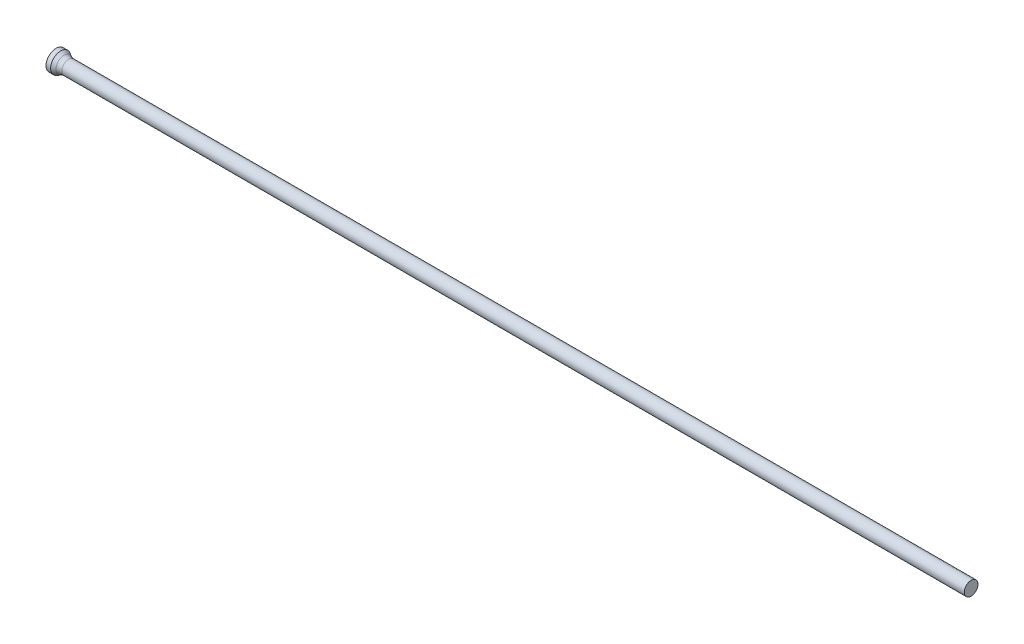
ISO-10303-21;
HEADER;
FILE_DESCRIPTION(('STEP AP214'),'2;1');
FILE_NAME('part.step','',(''),(''),'','','');
FILE_SCHEMA(('AUTOMOTIVE_DESIGN { 1 0 10303 214 1 1 1 1 }'));
ENDSEC;
DATA;
#1=APPLICATION_CONTEXT('core data for automotive mechanical design processes');
#2=APPLICATION_PROTOCOL_DEFINITION('international standard','automotive_design',2000,#1);
#3=PRODUCT_CONTEXT('',#1,'mechanical');
#4=PRODUCT('Part','Part','',(#3));
#5=PRODUCT_RELATED_PRODUCT_CATEGORY('part','',(#4));
#6=PRODUCT_DEFINITION_FORMATION('','',#4);
#7=PRODUCT_DEFINITION_CONTEXT('part definition',#1,'design');
#8=PRODUCT_DEFINITION('design','',#6,#7);
#9=PRODUCT_DEFINITION_SHAPE('','',#8);
#10=(LENGTH_UNIT() NAMED_UNIT(*) SI_UNIT(.MILLI.,.METRE.));
#11=(NAMED_UNIT(*) PLANE_ANGLE_UNIT() SI_UNIT($,.RADIAN.));
#12=(NAMED_UNIT(*) SI_UNIT($,.STERADIAN.) SOLID_ANGLE_UNIT());
#13=UNCERTAINTY_MEASURE_WITH_UNIT(LENGTH_MEASURE(1.E-05),#10,'distance_accuracy_value','');
#14=(GEOMETRIC_REPRESENTATION_CONTEXT(3) GLOBAL_UNCERTAINTY_ASSIGNED_CONTEXT((#13)) GLOBAL_UNIT_ASSIGNED_CONTEXT((#10,
#11,#12)) REPRESENTATION_CONTEXT('',''));
#15=CARTESIAN_POINT('',(0.,0.,0.));
#16=DIRECTION('',(0.,0.,1.));
#17=DIRECTION('',(1.,0.,0.));
#18=AXIS2_PLACEMENT_3D('',#15,#16,#17);
#19=CARTESIAN_POINT('',(0.,0.,0.));
#20=DIRECTION('',(1.,0.,0.));
#21=DIRECTION('',(0.,0.,-1.));
#22=AXIS2_PLACEMENT_3D('',#19,#20,#21);
#23=PLANE('',#22);
#24=CARTESIAN_POINT('',(0.,0.,0.));
#25=DIRECTION('',(-1.,0.,0.));
#26=DIRECTION('',(0.,0.,1.));
#27=AXIS2_PLACEMENT_3D('',#24,#25,#26);
#28=CIRCLE('',#27,1.1);
#29=CARTESIAN_POINT('',(0.,0.,1.1));
#30=VERTEX_POINT('',#29);
#31=EDGE_CURVE('E25',#30,#30,#28,.T.);
#32=ORIENTED_EDGE('',*,*,#31,.T.);
#33=EDGE_LOOP('',(#32));
#34=FACE_BOUND('',#33,.T.);
#35=ADVANCED_FACE('F14',(#34),#23,.F.);
#36=CARTESIAN_POINT('',(0.,0.,0.));
#37=DIRECTION('',(-1.,0.,0.));
#38=DIRECTION('',(0.,0.,1.));
#39=AXIS2_PLACEMENT_3D('',#36,#37,#38);
#40=CYLINDRICAL_SURFACE('',#39,1.1);
#41=ORIENTED_EDGE('',*,*,#31,.F.);
#42=EDGE_LOOP('',(#41));
#43=FACE_BOUND('',#42,.T.);
#44=CARTESIAN_POINT('',(0.503782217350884,0.,0.));
#45=DIRECTION('',(-1.,0.,0.));
#46=DIRECTION('',(0.,0.,1.));
#47=AXIS2_PLACEMENT_3D('',#44,#45,#46);
#48=CIRCLE('',#47,1.1);
#49=CARTESIAN_POINT('',(0.503782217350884,0.,1.1));
#50=VERTEX_POINT('',#49);
#51=EDGE_CURVE('E29',#50,#50,#48,.T.);
#52=ORIENTED_EDGE('',*,*,#51,.T.);
#53=EDGE_LOOP('',(#52));
#54=FACE_BOUND('',#53,.T.);
#55=ADVANCED_FACE('F53',(#43,#54),#40,.T.);
#56=CARTESIAN_POINT('',(1.11,0.,0.));
#57=DIRECTION('',(-1.,0.,0.));
#58=DIRECTION('',(0.,0.,1.));
#59=AXIS2_PLACEMENT_3D('',#56,#57,#58);
#60=CONICAL_SURFACE('',#59,0.75,0.523598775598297);
#61=CARTESIAN_POINT('',(0.877949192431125,0.,0.));
#62=DIRECTION('',(-1.,0.,0.));
#63=DIRECTION('',(0.,0.,1.));
#64=AXIS2_PLACEMENT_3D('',#61,#62,#63);
#65=CIRCLE('',#64,0.883974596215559);
#66=CARTESIAN_POINT('',(0.877949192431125,0.,0.883974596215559));
#67=VERTEX_POINT('',#66);
#68=EDGE_CURVE('E21',#67,#67,#65,.T.);
#69=ORIENTED_EDGE('',*,*,#68,.T.);
#70=EDGE_LOOP('',(#69));
#71=FACE_BOUND('',#70,.T.);
#72=ORIENTED_EDGE('',*,*,#51,.F.);
#73=EDGE_LOOP('',(#72));
#74=FACE_BOUND('',#73,.T.);
#75=ADVANCED_FACE('F50',(#71,#74),#60,.T.);
#76=CARTESIAN_POINT('',(0.,0.,0.));
#77=DIRECTION('',(-1.,0.,0.));
#78=DIRECTION('',(0.,0.,1.));
#79=AXIS2_PLACEMENT_3D('',#76,#77,#78);
#80=CYLINDRICAL_SURFACE('',#79,0.75);
#81=CARTESIAN_POINT('',(1.37794919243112,0.,0.));
#82=DIRECTION('',(-1.,0.,0.));
#83=DIRECTION('',(0.,0.,1.));
#84=AXIS2_PLACEMENT_3D('',#81,#82,#83);
#85=CIRCLE('',#84,0.75);
#86=CARTESIAN_POINT('',(1.37794919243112,0.,0.75));
#87=VERTEX_POINT('',#86);
#88=EDGE_CURVE('E9',#87,#87,#85,.F.);
#89=ORIENTED_EDGE('',*,*,#88,.T.);
#90=EDGE_LOOP('',(#89));
#91=FACE_BOUND('',#90,.T.);
#92=CARTESIAN_POINT('',(100.,0.,0.));
#93=DIRECTION('',(-1.,0.,0.));
#94=DIRECTION('',(0.,0.,1.));
#95=AXIS2_PLACEMENT_3D('',#92,#93,#94);
#96=CIRCLE('',#95,0.75);
#97=CARTESIAN_POINT('',(100.,0.,0.75));
#98=VERTEX_POINT('',#97);
#99=EDGE_CURVE('E34',#98,#98,#96,.T.);
#100=ORIENTED_EDGE('',*,*,#99,.T.);
#101=EDGE_LOOP('',(#100));
#102=FACE_BOUND('',#101,.T.);
#103=ADVANCED_FACE('F38',(#91,#102),#80,.T.);
#104=CARTESIAN_POINT('',(100.,0.75,0.));
#105=DIRECTION('',(-1.,0.,0.));
#106=DIRECTION('',(0.,0.,1.));
#107=AXIS2_PLACEMENT_3D('',#104,#105,#106);
#108=PLANE('',#107);
#109=ORIENTED_EDGE('',*,*,#99,.F.);
#110=EDGE_LOOP('',(#109));
#111=FACE_BOUND('',#110,.T.);
#112=ADVANCED_FACE('F40',(#111),#108,.F.);
#113=CARTESIAN_POINT('',(1.37794919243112,0.,0.));
#114=DIRECTION('',(-1.,0.,0.));
#115=DIRECTION('',(0.,0.,1.));
#116=AXIS2_PLACEMENT_3D('',#113,#114,#115);
#117=TOROIDAL_SURFACE('',#116,1.75,1.);
#118=ORIENTED_EDGE('',*,*,#88,.F.);
#119=EDGE_LOOP('',(#118));
#120=FACE_BOUND('',#119,.T.);
#121=ORIENTED_EDGE('',*,*,#68,.F.);
#122=EDGE_LOOP('',(#121));
#123=FACE_BOUND('',#122,.T.);
#124=ADVANCED_FACE('F16',(#120,#123),#117,.F.);
#125=CLOSED_SHELL('',(#35,#55,#75,#103,#112,#124));
#126=MANIFOLD_SOLID_BREP('B1',#125);
#127=ADVANCED_BREP_SHAPE_REPRESENTATION('',(#18,#126),#14);
#128=SHAPE_DEFINITION_REPRESENTATION(#9,#127);
ENDSEC;
END-ISO-10303-21;
